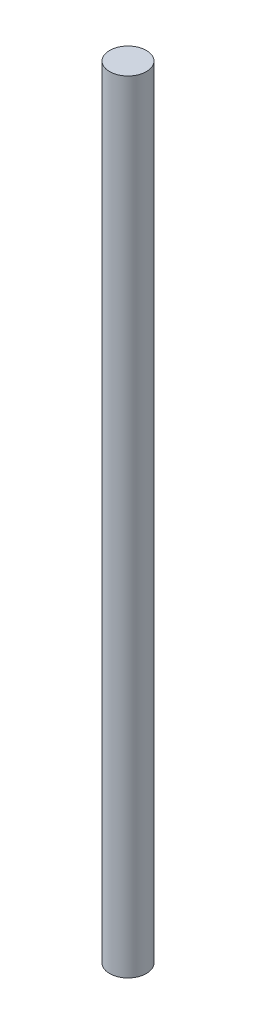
from build123d import *

# Parameters (mm, degrees)
ESQUISSE1_R        = 4
BOSS_EXTRU_1_DEPTH = 85


with BuildPart() as part:
    # Esquisse1 → Boss.-Extru.1 (new, symmetric)
    with BuildSketch(Plane(origin=(0, 0, 0), x_dir=(1, 0, 0), z_dir=(0, 1, 0))):
        with Locations(Location((0, 0, 0), (0, 0, 270))):
            Circle(ESQUISSE1_R)
    extrude(amount=BOSS_EXTRU_1_DEPTH, both=True)


solid = part.part
